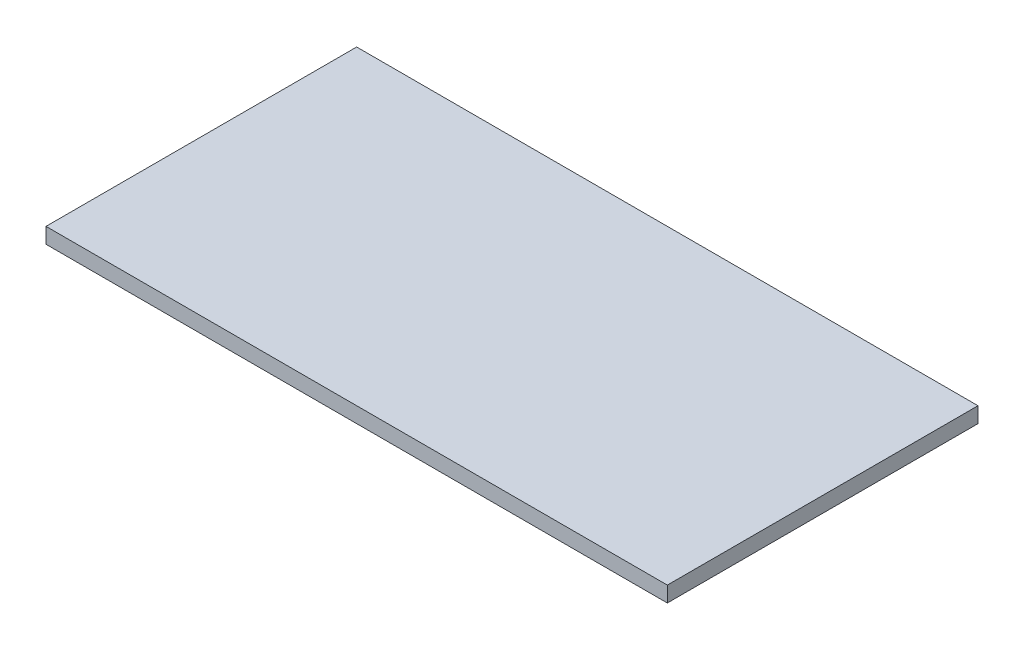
ISO-10303-21;
HEADER;
FILE_DESCRIPTION(('STEP AP214'),'2;1');
FILE_NAME('part.step','',(''),(''),'','','');
FILE_SCHEMA(('AUTOMOTIVE_DESIGN { 1 0 10303 214 1 1 1 1 }'));
ENDSEC;
DATA;
#1=APPLICATION_CONTEXT('core data for automotive mechanical design processes');
#2=APPLICATION_PROTOCOL_DEFINITION('international standard','automotive_design',2000,#1);
#3=PRODUCT_CONTEXT('',#1,'mechanical');
#4=PRODUCT('Part','Part','',(#3));
#5=PRODUCT_RELATED_PRODUCT_CATEGORY('part','',(#4));
#6=PRODUCT_DEFINITION_FORMATION('','',#4);
#7=PRODUCT_DEFINITION_CONTEXT('part definition',#1,'design');
#8=PRODUCT_DEFINITION('design','',#6,#7);
#9=PRODUCT_DEFINITION_SHAPE('','',#8);
#10=(LENGTH_UNIT() NAMED_UNIT(*) SI_UNIT(.MILLI.,.METRE.));
#11=(NAMED_UNIT(*) PLANE_ANGLE_UNIT() SI_UNIT($,.RADIAN.));
#12=(NAMED_UNIT(*) SI_UNIT($,.STERADIAN.) SOLID_ANGLE_UNIT());
#13=UNCERTAINTY_MEASURE_WITH_UNIT(LENGTH_MEASURE(1.E-05),#10,'distance_accuracy_value','');
#14=(GEOMETRIC_REPRESENTATION_CONTEXT(3) GLOBAL_UNCERTAINTY_ASSIGNED_CONTEXT((#13)) GLOBAL_UNIT_ASSIGNED_CONTEXT((#10,
#11,#12)) REPRESENTATION_CONTEXT('',''));
#15=CARTESIAN_POINT('',(0.,0.,0.));
#16=DIRECTION('',(0.,0.,1.));
#17=DIRECTION('',(1.,0.,0.));
#18=AXIS2_PLACEMENT_3D('',#15,#16,#17);
#19=CARTESIAN_POINT('',(0.,0.,1000.));
#20=DIRECTION('',(1.,0.,0.));
#21=DIRECTION('',(0.,0.,-1.));
#22=AXIS2_PLACEMENT_3D('',#19,#20,#21);
#23=PLANE('',#22);
#24=DIRECTION('',(0.,-1.,0.));
#25=VECTOR('',#24,1.);
#26=CARTESIAN_POINT('',(0.,0.,0.));
#27=LINE('',#26,#25);
#28=CARTESIAN_POINT('',(0.,50.,0.));
#29=VERTEX_POINT('',#28);
#30=CARTESIAN_POINT('',(0.,0.,0.));
#31=VERTEX_POINT('',#30);
#32=EDGE_CURVE('E95',#29,#31,#27,.T.);
#33=ORIENTED_EDGE('',*,*,#32,.T.);
#34=DIRECTION('',(0.,0.,-1.));
#35=VECTOR('',#34,1.);
#36=CARTESIAN_POINT('',(0.,0.,1000.));
#37=LINE('',#36,#35);
#38=CARTESIAN_POINT('',(0.,0.,1000.));
#39=VERTEX_POINT('',#38);
#40=EDGE_CURVE('E11',#39,#31,#37,.T.);
#41=ORIENTED_EDGE('',*,*,#40,.F.);
#42=DIRECTION('',(0.,-1.,0.));
#43=VECTOR('',#42,1.);
#44=CARTESIAN_POINT('',(0.,0.,1000.));
#45=LINE('',#44,#43);
#46=CARTESIAN_POINT('',(0.,50.,1000.));
#47=VERTEX_POINT('',#46);
#48=EDGE_CURVE('E83',#47,#39,#45,.T.);
#49=ORIENTED_EDGE('',*,*,#48,.F.);
#50=DIRECTION('',(0.,0.,-1.));
#51=VECTOR('',#50,1.);
#52=CARTESIAN_POINT('',(0.,50.,1000.));
#53=LINE('',#52,#51);
#54=EDGE_CURVE('E91',#47,#29,#53,.T.);
#55=ORIENTED_EDGE('',*,*,#54,.T.);
#56=EDGE_LOOP('',(#33,#41,#49,#55));
#57=FACE_BOUND('',#56,.T.);
#58=ADVANCED_FACE('F32',(#57),#23,.F.);
#59=CARTESIAN_POINT('',(0.,0.,1000.));
#60=DIRECTION('',(0.,1.,0.));
#61=DIRECTION('',(0.,0.,1.));
#62=AXIS2_PLACEMENT_3D('',#59,#60,#61);
#63=PLANE('',#62);
#64=DIRECTION('',(1.,0.,0.));
#65=VECTOR('',#64,1.);
#66=CARTESIAN_POINT('',(0.,0.,0.));
#67=LINE('',#66,#65);
#68=CARTESIAN_POINT('',(2000.,0.,0.));
#69=VERTEX_POINT('',#68);
#70=EDGE_CURVE('E87',#31,#69,#67,.T.);
#71=ORIENTED_EDGE('',*,*,#70,.T.);
#72=DIRECTION('',(0.,0.,-1.));
#73=VECTOR('',#72,1.);
#74=CARTESIAN_POINT('',(2000.,0.,1000.));
#75=LINE('',#74,#73);
#76=CARTESIAN_POINT('',(2000.,0.,1000.));
#77=VERTEX_POINT('',#76);
#78=EDGE_CURVE('E40',#77,#69,#75,.T.);
#79=ORIENTED_EDGE('',*,*,#78,.F.);
#80=DIRECTION('',(1.,0.,0.));
#81=VECTOR('',#80,1.);
#82=CARTESIAN_POINT('',(0.,0.,1000.));
#83=LINE('',#82,#81);
#84=EDGE_CURVE('E78',#39,#77,#83,.T.);
#85=ORIENTED_EDGE('',*,*,#84,.F.);
#86=ORIENTED_EDGE('',*,*,#40,.T.);
#87=EDGE_LOOP('',(#71,#79,#85,#86));
#88=FACE_BOUND('',#87,.T.);
#89=ADVANCED_FACE('F86',(#88),#63,.F.);
#90=CARTESIAN_POINT('',(2000.,0.,1000.));
#91=DIRECTION('',(-1.,0.,0.));
#92=DIRECTION('',(0.,0.,1.));
#93=AXIS2_PLACEMENT_3D('',#90,#91,#92);
#94=PLANE('',#93);
#95=DIRECTION('',(0.,1.,0.));
#96=VECTOR('',#95,1.);
#97=CARTESIAN_POINT('',(2000.,0.,0.));
#98=LINE('',#97,#96);
#99=CARTESIAN_POINT('',(2000.,50.,0.));
#100=VERTEX_POINT('',#99);
#101=EDGE_CURVE('E65',#69,#100,#98,.T.);
#102=ORIENTED_EDGE('',*,*,#101,.T.);
#103=DIRECTION('',(0.,0.,-1.));
#104=VECTOR('',#103,1.);
#105=CARTESIAN_POINT('',(2000.,50.,1000.));
#106=LINE('',#105,#104);
#107=CARTESIAN_POINT('',(2000.,50.,1000.));
#108=VERTEX_POINT('',#107);
#109=EDGE_CURVE('E88',#108,#100,#106,.T.);
#110=ORIENTED_EDGE('',*,*,#109,.F.);
#111=DIRECTION('',(0.,1.,0.));
#112=VECTOR('',#111,1.);
#113=CARTESIAN_POINT('',(2000.,0.,1000.));
#114=LINE('',#113,#112);
#115=EDGE_CURVE('E81',#77,#108,#114,.T.);
#116=ORIENTED_EDGE('',*,*,#115,.F.);
#117=ORIENTED_EDGE('',*,*,#78,.T.);
#118=EDGE_LOOP('',(#102,#110,#116,#117));
#119=FACE_BOUND('',#118,.T.);
#120=ADVANCED_FACE('F89',(#119),#94,.F.);
#121=CARTESIAN_POINT('',(0.,50.,1000.));
#122=DIRECTION('',(0.,-1.,0.));
#123=DIRECTION('',(0.,0.,-1.));
#124=AXIS2_PLACEMENT_3D('',#121,#122,#123);
#125=PLANE('',#124);
#126=DIRECTION('',(-1.,0.,0.));
#127=VECTOR('',#126,1.);
#128=CARTESIAN_POINT('',(0.,50.,0.));
#129=LINE('',#128,#127);
#130=EDGE_CURVE('E71',#100,#29,#129,.T.);
#131=ORIENTED_EDGE('',*,*,#130,.T.);
#132=ORIENTED_EDGE('',*,*,#54,.F.);
#133=DIRECTION('',(-1.,0.,0.));
#134=VECTOR('',#133,1.);
#135=CARTESIAN_POINT('',(0.,50.,1000.));
#136=LINE('',#135,#134);
#137=EDGE_CURVE('E48',#108,#47,#136,.T.);
#138=ORIENTED_EDGE('',*,*,#137,.F.);
#139=ORIENTED_EDGE('',*,*,#109,.T.);
#140=EDGE_LOOP('',(#131,#132,#138,#139));
#141=FACE_BOUND('',#140,.T.);
#142=ADVANCED_FACE('F102',(#141),#125,.F.);
#143=CARTESIAN_POINT('',(0.,0.,1000.));
#144=DIRECTION('',(0.,0.,-1.));
#145=DIRECTION('',(-1.,0.,0.));
#146=AXIS2_PLACEMENT_3D('',#143,#144,#145);
#147=PLANE('',#146);
#148=ORIENTED_EDGE('',*,*,#48,.T.);
#149=ORIENTED_EDGE('',*,*,#84,.T.);
#150=ORIENTED_EDGE('',*,*,#115,.T.);
#151=ORIENTED_EDGE('',*,*,#137,.T.);
#152=EDGE_LOOP('',(#148,#149,#150,#151));
#153=FACE_BOUND('',#152,.T.);
#154=ADVANCED_FACE('F79',(#153),#147,.F.);
#155=CARTESIAN_POINT('',(0.,0.,0.));
#156=DIRECTION('',(0.,0.,-1.));
#157=DIRECTION('',(-1.,0.,0.));
#158=AXIS2_PLACEMENT_3D('',#155,#156,#157);
#159=PLANE('',#158);
#160=ORIENTED_EDGE('',*,*,#32,.F.);
#161=ORIENTED_EDGE('',*,*,#130,.F.);
#162=ORIENTED_EDGE('',*,*,#101,.F.);
#163=ORIENTED_EDGE('',*,*,#70,.F.);
#164=EDGE_LOOP('',(#160,#161,#162,#163));
#165=FACE_BOUND('',#164,.T.);
#166=ADVANCED_FACE('F105',(#165),#159,.T.);
#167=CLOSED_SHELL('',(#58,#89,#120,#142,#154,#166));
#168=MANIFOLD_SOLID_BREP('B2',#167);
#169=ADVANCED_BREP_SHAPE_REPRESENTATION('',(#18,#168),#14);
#170=SHAPE_DEFINITION_REPRESENTATION(#9,#169);
ENDSEC;
END-ISO-10303-21;
